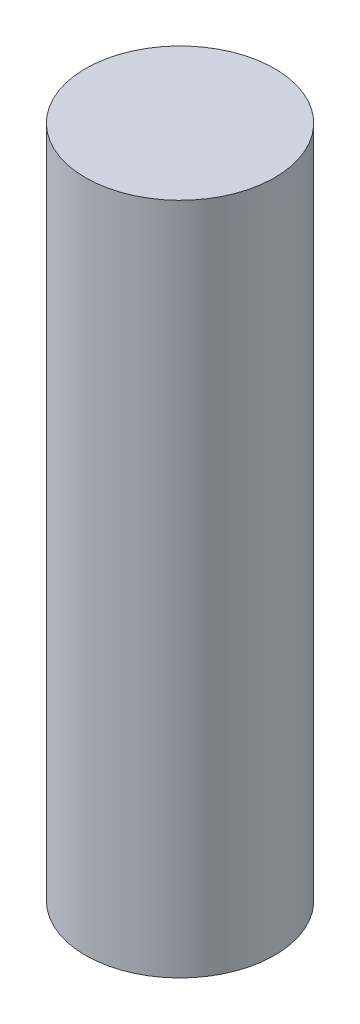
from build123d import *

# Parameters (mm, degrees)
SKETCH1_R           = 9.125
BOSS_EXTRUDE1_DEPTH = 65


with BuildPart() as part:
    # Sketch1 → Boss-Extrude1 (new body)
    with BuildSketch(Plane(origin=(0, 0, 0), x_dir=(1, 0, 0), z_dir=(0, 1, 0))):
        with Locations(Location((0, 0, 0), (0, 0, 270))):
            Circle(SKETCH1_R)
    extrude(amount=BOSS_EXTRUDE1_DEPTH)


solid = part.part
